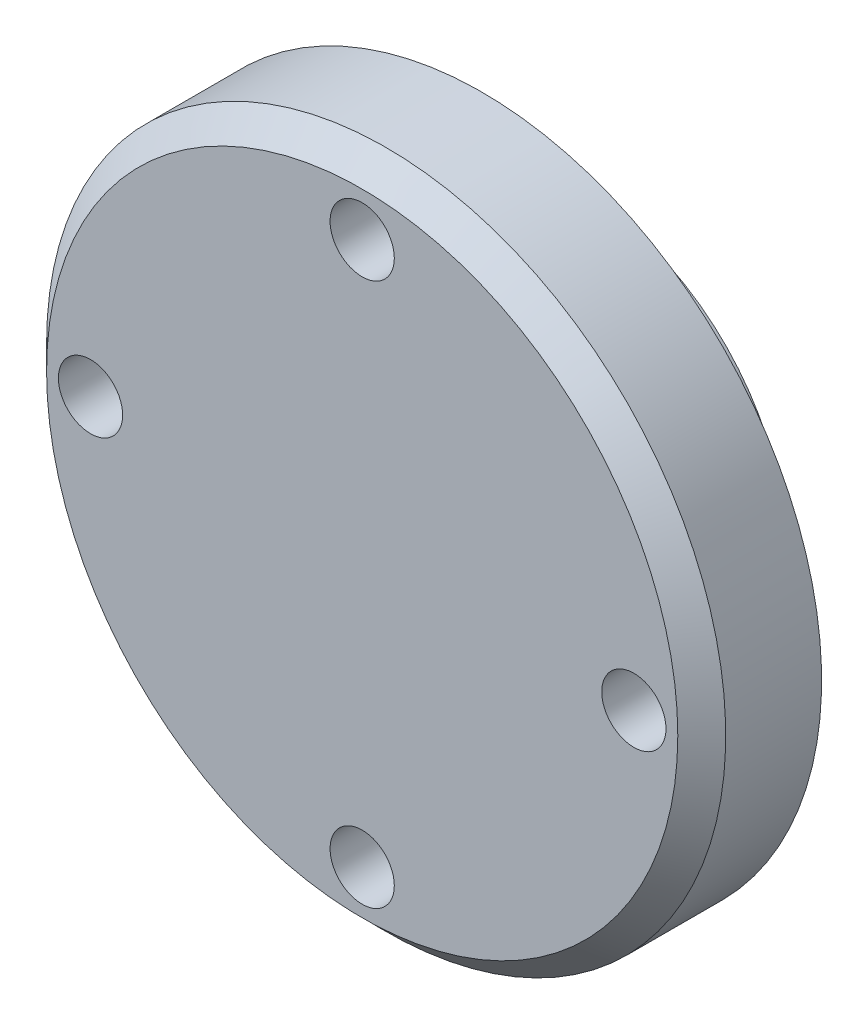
from build123d import *

# Parameters (mm, degrees)
SKETCH1_R              = 26.9875
BOSS_EXTRUDE1_DEPTH    = 9.525
SKETCH3_R              = 16.5227
BOSS_EXTRUDE2_DEPTH    = 7.62
SKETCH4_W              = 1.3462
SKETCH4_H              = 2.667
F_10_CLEARANCE_HOLE1_D = 5.1054
CHAMFER1_SIZE          = 1.905


with BuildPart() as part:
    # Sketch1 → Boss-Extrude1 (new body)
    with BuildSketch(Plane.XY):
        with Locations(Location((0, 0, 0), (0, 0, 180))):
            Circle(SKETCH1_R)
    extrude(amount=BOSS_EXTRUDE1_DEPTH)

    # Sketch3 → Boss-Extrude2 (add)
    with BuildSketch(Plane(origin=(0, 0, 0), x_dir=(-1, 0, 0), z_dir=(0, 0, -1))):
        with Locations(Location((0, 0, 0), (0, 0, 180))):
            Circle(SKETCH3_R)
    extrude(amount=BOSS_EXTRUDE2_DEPTH)

    # Sketch4 → Cut-Revolve3 (revolve, cut)
    with BuildSketch(Plane(origin=(0, 0, 0), x_dir=(1, 0, 0), z_dir=(0, 1, 0)), mode=Mode.PRIVATE) as cut_revolve3_sk:
        with Locations((-15.8496, 3.7465)):
            Rectangle(SKETCH4_W, SKETCH4_H)
    revolve(cut_revolve3_sk.sketch.rotate(Axis((0, 0, -8.47725), (0, 0, 1)), 180), axis=Axis((0, 0, -8.47725), (0, 0, 1)), mode=Mode.SUBTRACT)

    # 10 Clearance Hole1 (through all)
    with Locations(Plane.XY.offset(9.525)):
        with Locations((0, -21.59), (21.59, 0), (0, 21.59), (-21.59, 0)):
            Hole(F_10_CLEARANCE_HOLE1_D / 2)

    # Chamfer1
    chamfer1_edges = [part.edges().sort_by_distance(p)[0] for p in [
        (26.9875, 0, 9.525),
    ]]
    chamfer(chamfer1_edges, length=CHAMFER1_SIZE)


solid = part.part
